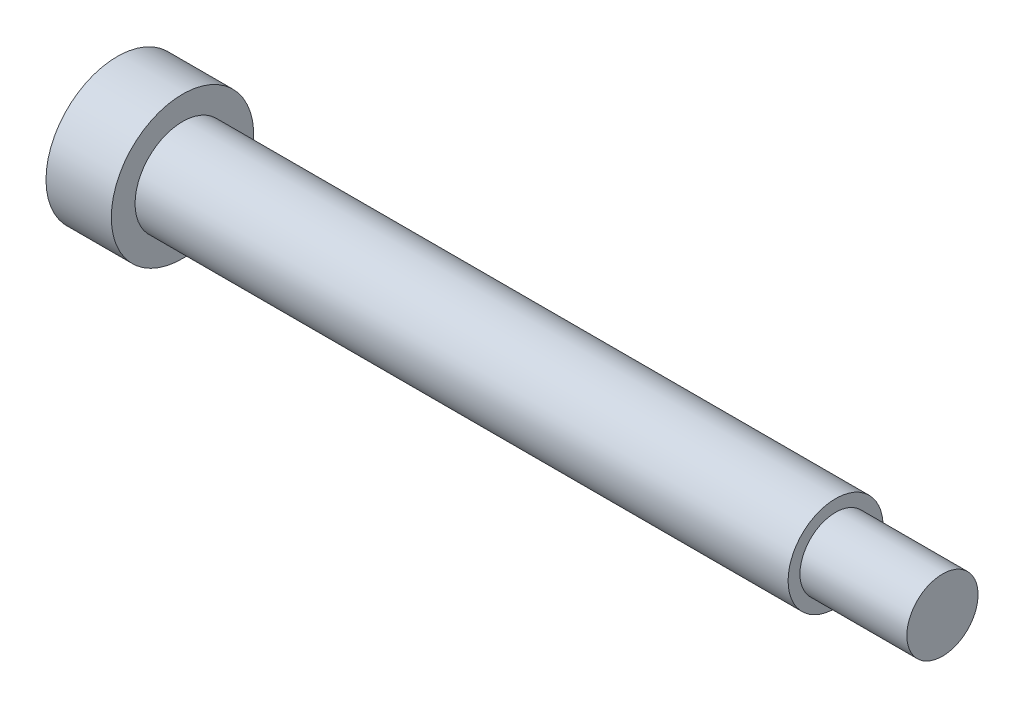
ISO-10303-21;
HEADER;
FILE_DESCRIPTION(('STEP AP214'),'2;1');
FILE_NAME('part.step','',(''),(''),'','','');
FILE_SCHEMA(('AUTOMOTIVE_DESIGN { 1 0 10303 214 1 1 1 1 }'));
ENDSEC;
DATA;
#1=APPLICATION_CONTEXT('core data for automotive mechanical design processes');
#2=APPLICATION_PROTOCOL_DEFINITION('international standard','automotive_design',2000,#1);
#3=PRODUCT_CONTEXT('',#1,'mechanical');
#4=PRODUCT('Part','Part','',(#3));
#5=PRODUCT_RELATED_PRODUCT_CATEGORY('part','',(#4));
#6=PRODUCT_DEFINITION_FORMATION('','',#4);
#7=PRODUCT_DEFINITION_CONTEXT('part definition',#1,'design');
#8=PRODUCT_DEFINITION('design','',#6,#7);
#9=PRODUCT_DEFINITION_SHAPE('','',#8);
#10=(LENGTH_UNIT() NAMED_UNIT(*) SI_UNIT(.MILLI.,.METRE.));
#11=(NAMED_UNIT(*) PLANE_ANGLE_UNIT() SI_UNIT($,.RADIAN.));
#12=(NAMED_UNIT(*) SI_UNIT($,.STERADIAN.) SOLID_ANGLE_UNIT());
#13=UNCERTAINTY_MEASURE_WITH_UNIT(LENGTH_MEASURE(1.E-05),#10,'distance_accuracy_value','');
#14=(GEOMETRIC_REPRESENTATION_CONTEXT(3) GLOBAL_UNCERTAINTY_ASSIGNED_CONTEXT((#13)) GLOBAL_UNIT_ASSIGNED_CONTEXT((#10,
#11,#12)) REPRESENTATION_CONTEXT('',''));
#15=CARTESIAN_POINT('',(0.,0.,0.));
#16=DIRECTION('',(0.,0.,1.));
#17=DIRECTION('',(1.,0.,0.));
#18=AXIS2_PLACEMENT_3D('',#15,#16,#17);
#19=CARTESIAN_POINT('',(0.,0.,0.));
#20=DIRECTION('',(1.,0.,0.));
#21=DIRECTION('',(0.,0.,-1.));
#22=AXIS2_PLACEMENT_3D('',#19,#20,#21);
#23=PLANE('',#22);
#24=DIRECTION('',(0.,0.866025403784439,-0.5));
#25=VECTOR('',#24,1.);
#26=CARTESIAN_POINT('',(0.,0.,4.));
#27=LINE('',#26,#25);
#28=CARTESIAN_POINT('',(0.,0.,4.));
#29=VERTEX_POINT('',#28);
#30=CARTESIAN_POINT('',(0.,3.46410161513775,2.));
#31=VERTEX_POINT('',#30);
#32=EDGE_CURVE('E104',#29,#31,#27,.T.);
#33=ORIENTED_EDGE('',*,*,#32,.F.);
#34=DIRECTION('',(0.,0.866025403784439,0.5));
#35=VECTOR('',#34,1.);
#36=CARTESIAN_POINT('',(0.,-3.46410161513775,2.));
#37=LINE('',#36,#35);
#38=CARTESIAN_POINT('',(0.,-3.46410161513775,2.));
#39=VERTEX_POINT('',#38);
#40=EDGE_CURVE('E30',#39,#29,#37,.T.);
#41=ORIENTED_EDGE('',*,*,#40,.F.);
#42=DIRECTION('',(0.,0.,1.));
#43=VECTOR('',#42,1.);
#44=CARTESIAN_POINT('',(0.,-3.46410161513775,-2.));
#45=LINE('',#44,#43);
#46=CARTESIAN_POINT('',(0.,-3.46410161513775,-2.));
#47=VERTEX_POINT('',#46);
#48=EDGE_CURVE('E113',#47,#39,#45,.T.);
#49=ORIENTED_EDGE('',*,*,#48,.F.);
#50=DIRECTION('',(0.,-0.866025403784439,0.5));
#51=VECTOR('',#50,1.);
#52=CARTESIAN_POINT('',(0.,0.,-4.));
#53=LINE('',#52,#51);
#54=CARTESIAN_POINT('',(0.,0.,-4.));
#55=VERTEX_POINT('',#54);
#56=EDGE_CURVE('E111',#55,#47,#53,.T.);
#57=ORIENTED_EDGE('',*,*,#56,.F.);
#58=DIRECTION('',(0.,-0.866025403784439,-0.5));
#59=VECTOR('',#58,1.);
#60=CARTESIAN_POINT('',(0.,3.46410161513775,-2.));
#61=LINE('',#60,#59);
#62=CARTESIAN_POINT('',(0.,3.46410161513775,-2.));
#63=VERTEX_POINT('',#62);
#64=EDGE_CURVE('E78',#63,#55,#61,.T.);
#65=ORIENTED_EDGE('',*,*,#64,.F.);
#66=DIRECTION('',(0.,0.,-1.));
#67=VECTOR('',#66,1.);
#68=CARTESIAN_POINT('',(0.,3.46410161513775,2.));
#69=LINE('',#68,#67);
#70=EDGE_CURVE('E107',#31,#63,#69,.T.);
#71=ORIENTED_EDGE('',*,*,#70,.F.);
#72=EDGE_LOOP('',(#33,#41,#49,#57,#65,#71));
#73=FACE_BOUND('',#72,.T.);
#74=CARTESIAN_POINT('',(0.,0.,0.));
#75=DIRECTION('',(-1.,0.,0.));
#76=DIRECTION('',(0.,0.,1.));
#77=AXIS2_PLACEMENT_3D('',#74,#75,#76);
#78=CIRCLE('',#77,12.);
#79=CARTESIAN_POINT('',(0.,0.,12.));
#80=VERTEX_POINT('',#79);
#81=EDGE_CURVE('E10',#80,#80,#78,.T.);
#82=ORIENTED_EDGE('',*,*,#81,.T.);
#83=EDGE_LOOP('',(#82));
#84=FACE_BOUND('',#83,.T.);
#85=ADVANCED_FACE('F16',(#73,#84),#23,.F.);
#86=CARTESIAN_POINT('',(0.,0.,0.));
#87=DIRECTION('',(-1.,0.,0.));
#88=DIRECTION('',(0.,0.,1.));
#89=AXIS2_PLACEMENT_3D('',#86,#87,#88);
#90=CYLINDRICAL_SURFACE('',#89,12.);
#91=ORIENTED_EDGE('',*,*,#81,.F.);
#92=EDGE_LOOP('',(#91));
#93=FACE_BOUND('',#92,.T.);
#94=CARTESIAN_POINT('',(11.,0.,0.));
#95=DIRECTION('',(-1.,0.,0.));
#96=DIRECTION('',(0.,0.,1.));
#97=AXIS2_PLACEMENT_3D('',#94,#95,#96);
#98=CIRCLE('',#97,12.);
#99=CARTESIAN_POINT('',(11.,0.,12.));
#100=VERTEX_POINT('',#99);
#101=EDGE_CURVE('E23',#100,#100,#98,.T.);
#102=ORIENTED_EDGE('',*,*,#101,.T.);
#103=EDGE_LOOP('',(#102));
#104=FACE_BOUND('',#103,.T.);
#105=ADVANCED_FACE('F136',(#93,#104),#90,.T.);
#106=CARTESIAN_POINT('',(11.,12.,0.));
#107=DIRECTION('',(-1.,0.,0.));
#108=DIRECTION('',(0.,0.,1.));
#109=AXIS2_PLACEMENT_3D('',#106,#107,#108);
#110=PLANE('',#109);
#111=ORIENTED_EDGE('',*,*,#101,.F.);
#112=EDGE_LOOP('',(#111));
#113=FACE_BOUND('',#112,.T.);
#114=CARTESIAN_POINT('',(11.,0.,0.));
#115=DIRECTION('',(-1.,0.,0.));
#116=DIRECTION('',(0.,0.,1.));
#117=AXIS2_PLACEMENT_3D('',#114,#115,#116);
#118=CIRCLE('',#117,8.);
#119=CARTESIAN_POINT('',(11.,0.,8.));
#120=VERTEX_POINT('',#119);
#121=EDGE_CURVE('E131',#120,#120,#118,.T.);
#122=ORIENTED_EDGE('',*,*,#121,.T.);
#123=EDGE_LOOP('',(#122));
#124=FACE_BOUND('',#123,.T.);
#125=ADVANCED_FACE('F138',(#113,#124),#110,.F.);
#126=CARTESIAN_POINT('',(0.,0.,0.));
#127=DIRECTION('',(-1.,0.,0.));
#128=DIRECTION('',(0.,0.,1.));
#129=AXIS2_PLACEMENT_3D('',#126,#127,#128);
#130=CYLINDRICAL_SURFACE('',#129,8.);
#131=ORIENTED_EDGE('',*,*,#121,.F.);
#132=EDGE_LOOP('',(#131));
#133=FACE_BOUND('',#132,.T.);
#134=CARTESIAN_POINT('',(121.,0.,0.));
#135=DIRECTION('',(-1.,0.,0.));
#136=DIRECTION('',(0.,0.,1.));
#137=AXIS2_PLACEMENT_3D('',#134,#135,#136);
#138=CIRCLE('',#137,8.);
#139=CARTESIAN_POINT('',(121.,0.,8.));
#140=VERTEX_POINT('',#139);
#141=EDGE_CURVE('E128',#140,#140,#138,.T.);
#142=ORIENTED_EDGE('',*,*,#141,.T.);
#143=EDGE_LOOP('',(#142));
#144=FACE_BOUND('',#143,.T.);
#145=ADVANCED_FACE('F141',(#133,#144),#130,.T.);
#146=CARTESIAN_POINT('',(121.,8.,0.));
#147=DIRECTION('',(-1.,0.,0.));
#148=DIRECTION('',(0.,0.,1.));
#149=AXIS2_PLACEMENT_3D('',#146,#147,#148);
#150=PLANE('',#149);
#151=ORIENTED_EDGE('',*,*,#141,.F.);
#152=EDGE_LOOP('',(#151));
#153=FACE_BOUND('',#152,.T.);
#154=CARTESIAN_POINT('',(121.,0.,0.));
#155=DIRECTION('',(-1.,0.,0.));
#156=DIRECTION('',(0.,0.,1.));
#157=AXIS2_PLACEMENT_3D('',#154,#155,#156);
#158=CIRCLE('',#157,6.);
#159=CARTESIAN_POINT('',(121.,0.,6.));
#160=VERTEX_POINT('',#159);
#161=EDGE_CURVE('E125',#160,#160,#158,.T.);
#162=ORIENTED_EDGE('',*,*,#161,.T.);
#163=EDGE_LOOP('',(#162));
#164=FACE_BOUND('',#163,.T.);
#165=ADVANCED_FACE('F147',(#153,#164),#150,.F.);
#166=CARTESIAN_POINT('',(0.,0.,0.));
#167=DIRECTION('',(-1.,0.,0.));
#168=DIRECTION('',(0.,0.,1.));
#169=AXIS2_PLACEMENT_3D('',#166,#167,#168);
#170=CYLINDRICAL_SURFACE('',#169,6.);
#171=ORIENTED_EDGE('',*,*,#161,.F.);
#172=EDGE_LOOP('',(#171));
#173=FACE_BOUND('',#172,.T.);
#174=CARTESIAN_POINT('',(139.,0.,0.));
#175=DIRECTION('',(-1.,0.,0.));
#176=DIRECTION('',(0.,0.,1.));
#177=AXIS2_PLACEMENT_3D('',#174,#175,#176);
#178=CIRCLE('',#177,6.);
#179=CARTESIAN_POINT('',(139.,0.,6.));
#180=VERTEX_POINT('',#179);
#181=EDGE_CURVE('E117',#180,#180,#178,.T.);
#182=ORIENTED_EDGE('',*,*,#181,.T.);
#183=EDGE_LOOP('',(#182));
#184=FACE_BOUND('',#183,.T.);
#185=ADVANCED_FACE('F153',(#173,#184),#170,.T.);
#186=CARTESIAN_POINT('',(139.,6.,0.));
#187=DIRECTION('',(-1.,0.,0.));
#188=DIRECTION('',(0.,0.,1.));
#189=AXIS2_PLACEMENT_3D('',#186,#187,#188);
#190=PLANE('',#189);
#191=ORIENTED_EDGE('',*,*,#181,.F.);
#192=EDGE_LOOP('',(#191));
#193=FACE_BOUND('',#192,.T.);
#194=ADVANCED_FACE('F159',(#193),#190,.F.);
#195=CARTESIAN_POINT('',(8.,-3.46410161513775,2.));
#196=DIRECTION('',(0.,-0.5,0.866025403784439));
#197=DIRECTION('',(0.,-0.866025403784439,-0.5));
#198=AXIS2_PLACEMENT_3D('',#195,#196,#197);
#199=PLANE('',#198);
#200=ORIENTED_EDGE('',*,*,#40,.T.);
#201=DIRECTION('',(-1.,0.,0.));
#202=VECTOR('',#201,1.);
#203=CARTESIAN_POINT('',(8.,0.,4.));
#204=LINE('',#203,#202);
#205=CARTESIAN_POINT('',(8.,0.,4.));
#206=VERTEX_POINT('',#205);
#207=EDGE_CURVE('E60',#206,#29,#204,.T.);
#208=ORIENTED_EDGE('',*,*,#207,.F.);
#209=DIRECTION('',(0.,0.866025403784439,0.5));
#210=VECTOR('',#209,1.);
#211=CARTESIAN_POINT('',(8.,-3.46410161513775,2.));
#212=LINE('',#211,#210);
#213=CARTESIAN_POINT('',(8.,-3.46410161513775,2.));
#214=VERTEX_POINT('',#213);
#215=EDGE_CURVE('E115',#214,#206,#212,.T.);
#216=ORIENTED_EDGE('',*,*,#215,.F.);
#217=DIRECTION('',(-1.,0.,0.));
#218=VECTOR('',#217,1.);
#219=CARTESIAN_POINT('',(8.,-3.46410161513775,2.));
#220=LINE('',#219,#218);
#221=EDGE_CURVE('E38',#214,#39,#220,.T.);
#222=ORIENTED_EDGE('',*,*,#221,.T.);
#223=EDGE_LOOP('',(#200,#208,#216,#222));
#224=FACE_BOUND('',#223,.T.);
#225=ADVANCED_FACE('F164',(#224),#199,.F.);
#226=CARTESIAN_POINT('',(8.,-3.46410161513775,-2.));
#227=DIRECTION('',(0.,-1.,0.));
#228=DIRECTION('',(0.,0.,-1.));
#229=AXIS2_PLACEMENT_3D('',#226,#227,#228);
#230=PLANE('',#229);
#231=ORIENTED_EDGE('',*,*,#48,.T.);
#232=ORIENTED_EDGE('',*,*,#221,.F.);
#233=DIRECTION('',(0.,0.,1.));
#234=VECTOR('',#233,1.);
#235=CARTESIAN_POINT('',(8.,-3.46410161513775,-2.));
#236=LINE('',#235,#234);
#237=CARTESIAN_POINT('',(8.,-3.46410161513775,-2.));
#238=VERTEX_POINT('',#237);
#239=EDGE_CURVE('E90',#238,#214,#236,.T.);
#240=ORIENTED_EDGE('',*,*,#239,.F.);
#241=DIRECTION('',(-1.,0.,0.));
#242=VECTOR('',#241,1.);
#243=CARTESIAN_POINT('',(8.,-3.46410161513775,-2.));
#244=LINE('',#243,#242);
#245=EDGE_CURVE('E82',#238,#47,#244,.T.);
#246=ORIENTED_EDGE('',*,*,#245,.T.);
#247=EDGE_LOOP('',(#231,#232,#240,#246));
#248=FACE_BOUND('',#247,.T.);
#249=ADVANCED_FACE('F171',(#248),#230,.F.);
#250=CARTESIAN_POINT('',(8.,0.,-4.));
#251=DIRECTION('',(0.,-0.5,-0.866025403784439));
#252=DIRECTION('',(0.,0.866025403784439,-0.5));
#253=AXIS2_PLACEMENT_3D('',#250,#251,#252);
#254=PLANE('',#253);
#255=ORIENTED_EDGE('',*,*,#56,.T.);
#256=ORIENTED_EDGE('',*,*,#245,.F.);
#257=DIRECTION('',(0.,-0.866025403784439,0.5));
#258=VECTOR('',#257,1.);
#259=CARTESIAN_POINT('',(8.,0.,-4.));
#260=LINE('',#259,#258);
#261=CARTESIAN_POINT('',(8.,0.,-4.));
#262=VERTEX_POINT('',#261);
#263=EDGE_CURVE('E86',#262,#238,#260,.T.);
#264=ORIENTED_EDGE('',*,*,#263,.F.);
#265=DIRECTION('',(-1.,0.,0.));
#266=VECTOR('',#265,1.);
#267=CARTESIAN_POINT('',(8.,0.,-4.));
#268=LINE('',#267,#266);
#269=EDGE_CURVE('E71',#262,#55,#268,.T.);
#270=ORIENTED_EDGE('',*,*,#269,.T.);
#271=EDGE_LOOP('',(#255,#256,#264,#270));
#272=FACE_BOUND('',#271,.T.);
#273=ADVANCED_FACE('F87',(#272),#254,.F.);
#274=CARTESIAN_POINT('',(8.,3.46410161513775,-2.));
#275=DIRECTION('',(0.,0.5,-0.866025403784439));
#276=DIRECTION('',(0.,0.866025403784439,0.5));
#277=AXIS2_PLACEMENT_3D('',#274,#275,#276);
#278=PLANE('',#277);
#279=ORIENTED_EDGE('',*,*,#64,.T.);
#280=ORIENTED_EDGE('',*,*,#269,.F.);
#281=DIRECTION('',(0.,-0.866025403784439,-0.5));
#282=VECTOR('',#281,1.);
#283=CARTESIAN_POINT('',(8.,3.46410161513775,-2.));
#284=LINE('',#283,#282);
#285=CARTESIAN_POINT('',(8.,3.46410161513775,-2.));
#286=VERTEX_POINT('',#285);
#287=EDGE_CURVE('E75',#286,#262,#284,.T.);
#288=ORIENTED_EDGE('',*,*,#287,.F.);
#289=DIRECTION('',(-1.,0.,0.));
#290=VECTOR('',#289,1.);
#291=CARTESIAN_POINT('',(8.,3.46410161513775,-2.));
#292=LINE('',#291,#290);
#293=EDGE_CURVE('E83',#286,#63,#292,.T.);
#294=ORIENTED_EDGE('',*,*,#293,.T.);
#295=EDGE_LOOP('',(#279,#280,#288,#294));
#296=FACE_BOUND('',#295,.T.);
#297=ADVANCED_FACE('F73',(#296),#278,.F.);
#298=CARTESIAN_POINT('',(8.,3.46410161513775,2.));
#299=DIRECTION('',(0.,1.,0.));
#300=DIRECTION('',(0.,0.,1.));
#301=AXIS2_PLACEMENT_3D('',#298,#299,#300);
#302=PLANE('',#301);
#303=ORIENTED_EDGE('',*,*,#70,.T.);
#304=ORIENTED_EDGE('',*,*,#293,.F.);
#305=DIRECTION('',(0.,0.,-1.));
#306=VECTOR('',#305,1.);
#307=CARTESIAN_POINT('',(8.,3.46410161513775,2.));
#308=LINE('',#307,#306);
#309=CARTESIAN_POINT('',(8.,3.46410161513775,2.));
#310=VERTEX_POINT('',#309);
#311=EDGE_CURVE('E96',#310,#286,#308,.T.);
#312=ORIENTED_EDGE('',*,*,#311,.F.);
#313=DIRECTION('',(-1.,0.,0.));
#314=VECTOR('',#313,1.);
#315=CARTESIAN_POINT('',(8.,3.46410161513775,2.));
#316=LINE('',#315,#314);
#317=EDGE_CURVE('E120',#310,#31,#316,.T.);
#318=ORIENTED_EDGE('',*,*,#317,.T.);
#319=EDGE_LOOP('',(#303,#304,#312,#318));
#320=FACE_BOUND('',#319,.T.);
#321=ADVANCED_FACE('F199',(#320),#302,.F.);
#322=CARTESIAN_POINT('',(8.,0.,4.));
#323=DIRECTION('',(0.,0.5,0.866025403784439));
#324=DIRECTION('',(0.,-0.866025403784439,0.5));
#325=AXIS2_PLACEMENT_3D('',#322,#323,#324);
#326=PLANE('',#325);
#327=ORIENTED_EDGE('',*,*,#32,.T.);
#328=ORIENTED_EDGE('',*,*,#317,.F.);
#329=DIRECTION('',(0.,0.866025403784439,-0.5));
#330=VECTOR('',#329,1.);
#331=CARTESIAN_POINT('',(8.,0.,4.));
#332=LINE('',#331,#330);
#333=EDGE_CURVE('E98',#206,#310,#332,.T.);
#334=ORIENTED_EDGE('',*,*,#333,.F.);
#335=ORIENTED_EDGE('',*,*,#207,.T.);
#336=EDGE_LOOP('',(#327,#328,#334,#335));
#337=FACE_BOUND('',#336,.T.);
#338=ADVANCED_FACE('F186',(#337),#326,.F.);
#339=CARTESIAN_POINT('',(8.,0.,0.));
#340=DIRECTION('',(-1.,0.,0.));
#341=DIRECTION('',(0.,0.,1.));
#342=AXIS2_PLACEMENT_3D('',#339,#340,#341);
#343=PLANE('',#342);
#344=ORIENTED_EDGE('',*,*,#215,.T.);
#345=ORIENTED_EDGE('',*,*,#333,.T.);
#346=ORIENTED_EDGE('',*,*,#311,.T.);
#347=ORIENTED_EDGE('',*,*,#287,.T.);
#348=ORIENTED_EDGE('',*,*,#263,.T.);
#349=ORIENTED_EDGE('',*,*,#239,.T.);
#350=EDGE_LOOP('',(#344,#345,#346,#347,#348,#349));
#351=FACE_BOUND('',#350,.T.);
#352=ADVANCED_FACE('F93',(#351),#343,.T.);
#353=CLOSED_SHELL('',(#85,#105,#125,#145,#165,#185,#194,#225,#249,#273,#297,#321,#338,#352));
#354=MANIFOLD_SOLID_BREP('B1',#353);
#355=ADVANCED_BREP_SHAPE_REPRESENTATION('',(#18,#354),#14);
#356=SHAPE_DEFINITION_REPRESENTATION(#9,#355);
ENDSEC;
END-ISO-10303-21;
